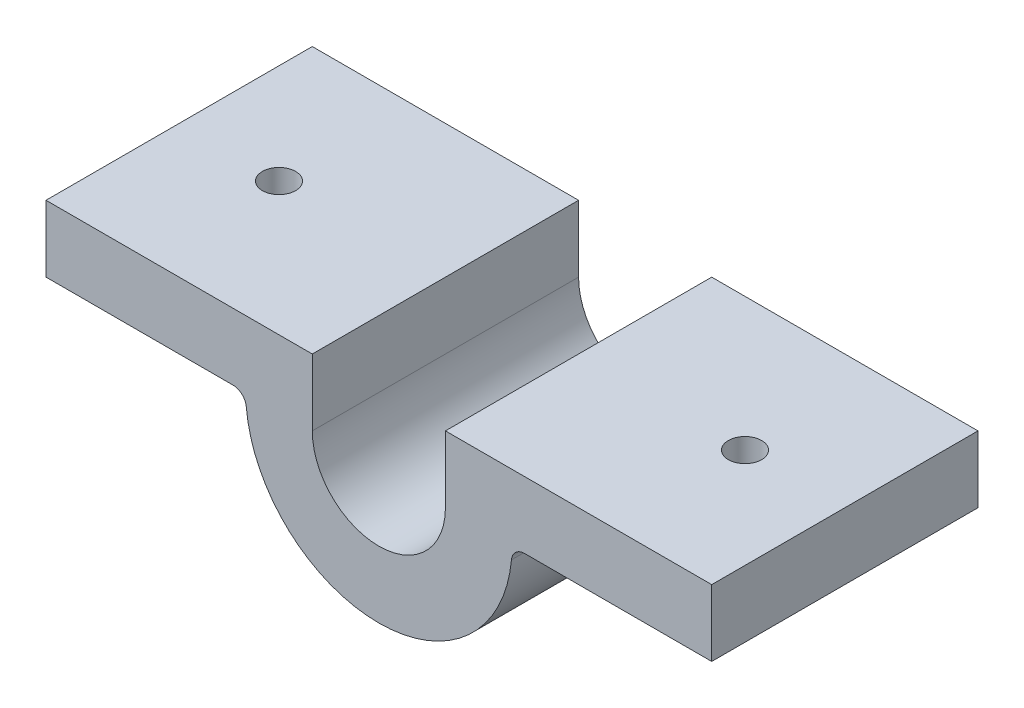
ISO-10303-21;
HEADER;
FILE_DESCRIPTION(('STEP AP214'),'2;1');
FILE_NAME('part.step','',(''),(''),'','','');
FILE_SCHEMA(('AUTOMOTIVE_DESIGN { 1 0 10303 214 1 1 1 1 }'));
ENDSEC;
DATA;
#1=APPLICATION_CONTEXT('core data for automotive mechanical design processes');
#2=APPLICATION_PROTOCOL_DEFINITION('international standard','automotive_design',2000,#1);
#3=PRODUCT_CONTEXT('',#1,'mechanical');
#4=PRODUCT('Part','Part','',(#3));
#5=PRODUCT_RELATED_PRODUCT_CATEGORY('part','',(#4));
#6=PRODUCT_DEFINITION_FORMATION('','',#4);
#7=PRODUCT_DEFINITION_CONTEXT('part definition',#1,'design');
#8=PRODUCT_DEFINITION('design','',#6,#7);
#9=PRODUCT_DEFINITION_SHAPE('','',#8);
#10=(LENGTH_UNIT() NAMED_UNIT(*) SI_UNIT(.MILLI.,.METRE.));
#11=(NAMED_UNIT(*) PLANE_ANGLE_UNIT() SI_UNIT($,.RADIAN.));
#12=(NAMED_UNIT(*) SI_UNIT($,.STERADIAN.) SOLID_ANGLE_UNIT());
#13=UNCERTAINTY_MEASURE_WITH_UNIT(LENGTH_MEASURE(1.E-05),#10,'distance_accuracy_value','');
#14=(GEOMETRIC_REPRESENTATION_CONTEXT(3) GLOBAL_UNCERTAINTY_ASSIGNED_CONTEXT((#13)) GLOBAL_UNIT_ASSIGNED_CONTEXT((#10,
#11,#12)) REPRESENTATION_CONTEXT('',''));
#15=CARTESIAN_POINT('',(0.,0.,0.));
#16=DIRECTION('',(0.,0.,1.));
#17=DIRECTION('',(1.,0.,0.));
#18=AXIS2_PLACEMENT_3D('',#15,#16,#17);
#19=CARTESIAN_POINT('',(-25.,5.,-20.));
#20=DIRECTION('',(-1.,0.,0.));
#21=DIRECTION('',(0.,0.,1.));
#22=AXIS2_PLACEMENT_3D('',#19,#20,#21);
#23=PLANE('',#22);
#24=DIRECTION('',(0.,-1.,0.));
#25=VECTOR('',#24,1.);
#26=CARTESIAN_POINT('',(-25.,5.,0.));
#27=LINE('',#26,#25);
#28=CARTESIAN_POINT('',(-25.,5.,0.));
#29=VERTEX_POINT('',#28);
#30=CARTESIAN_POINT('',(-25.,0.,0.));
#31=VERTEX_POINT('',#30);
#32=EDGE_CURVE('E170',#29,#31,#27,.T.);
#33=ORIENTED_EDGE('',*,*,#32,.F.);
#34=DIRECTION('',(0.,0.,1.));
#35=VECTOR('',#34,1.);
#36=CARTESIAN_POINT('',(-25.,5.,-20.));
#37=LINE('',#36,#35);
#38=CARTESIAN_POINT('',(-25.,5.,-20.));
#39=VERTEX_POINT('',#38);
#40=EDGE_CURVE('E140',#39,#29,#37,.T.);
#41=ORIENTED_EDGE('',*,*,#40,.F.);
#42=DIRECTION('',(0.,-1.,0.));
#43=VECTOR('',#42,1.);
#44=CARTESIAN_POINT('',(-25.,5.,-20.));
#45=LINE('',#44,#43);
#46=CARTESIAN_POINT('',(-25.,0.,-20.));
#47=VERTEX_POINT('',#46);
#48=EDGE_CURVE('E136',#39,#47,#45,.T.);
#49=ORIENTED_EDGE('',*,*,#48,.T.);
#50=DIRECTION('',(0.,0.,1.));
#51=VECTOR('',#50,1.);
#52=CARTESIAN_POINT('',(-25.,0.,-20.));
#53=LINE('',#52,#51);
#54=EDGE_CURVE('E121',#47,#31,#53,.T.);
#55=ORIENTED_EDGE('',*,*,#54,.T.);
#56=EDGE_LOOP('',(#33,#41,#49,#55));
#57=FACE_BOUND('',#56,.T.);
#58=ADVANCED_FACE('F33',(#57),#23,.T.);
#59=CARTESIAN_POINT('',(-25.,5.,-20.));
#60=DIRECTION('',(0.,1.,0.));
#61=DIRECTION('',(0.,0.,1.));
#62=AXIS2_PLACEMENT_3D('',#59,#60,#61);
#63=PLANE('',#62);
#64=CARTESIAN_POINT('',(-17.5,5.,-10.));
#65=DIRECTION('',(0.,1.,0.));
#66=DIRECTION('',(0.,0.,1.));
#67=AXIS2_PLACEMENT_3D('',#64,#65,#66);
#68=CIRCLE('',#67,1.25);
#69=CARTESIAN_POINT('',(-17.5,5.,-8.75));
#70=VERTEX_POINT('',#69);
#71=EDGE_CURVE('E283',#70,#70,#68,.T.);
#72=ORIENTED_EDGE('',*,*,#71,.F.);
#73=EDGE_LOOP('',(#72));
#74=FACE_BOUND('',#73,.T.);
#75=DIRECTION('',(-1.,0.,0.));
#76=VECTOR('',#75,1.);
#77=CARTESIAN_POINT('',(-25.,5.,0.));
#78=LINE('',#77,#76);
#79=CARTESIAN_POINT('',(-5.,5.,0.));
#80=VERTEX_POINT('',#79);
#81=EDGE_CURVE('E141',#80,#29,#78,.T.);
#82=ORIENTED_EDGE('',*,*,#81,.F.);
#83=DIRECTION('',(0.,0.,1.));
#84=VECTOR('',#83,1.);
#85=CARTESIAN_POINT('',(-5.,5.,-20.));
#86=LINE('',#85,#84);
#87=CARTESIAN_POINT('',(-5.,5.,-20.));
#88=VERTEX_POINT('',#87);
#89=EDGE_CURVE('E194',#88,#80,#86,.T.);
#90=ORIENTED_EDGE('',*,*,#89,.F.);
#91=DIRECTION('',(-1.,0.,0.));
#92=VECTOR('',#91,1.);
#93=CARTESIAN_POINT('',(-25.,5.,-20.));
#94=LINE('',#93,#92);
#95=EDGE_CURVE('E131',#88,#39,#94,.T.);
#96=ORIENTED_EDGE('',*,*,#95,.T.);
#97=ORIENTED_EDGE('',*,*,#40,.T.);
#98=EDGE_LOOP('',(#82,#90,#96,#97));
#99=FACE_BOUND('',#98,.T.);
#100=ADVANCED_FACE('F231',(#74,#99),#63,.T.);
#101=CARTESIAN_POINT('',(-5.,5.,-20.));
#102=DIRECTION('',(1.,0.,0.));
#103=DIRECTION('',(0.,0.,-1.));
#104=AXIS2_PLACEMENT_3D('',#101,#102,#103);
#105=PLANE('',#104);
#106=DIRECTION('',(0.,1.,0.));
#107=VECTOR('',#106,1.);
#108=CARTESIAN_POINT('',(-5.,5.,0.));
#109=LINE('',#108,#107);
#110=CARTESIAN_POINT('',(-5.,0.,0.));
#111=VERTEX_POINT('',#110);
#112=EDGE_CURVE('E144',#111,#80,#109,.T.);
#113=ORIENTED_EDGE('',*,*,#112,.F.);
#114=DIRECTION('',(0.,0.,1.));
#115=VECTOR('',#114,1.);
#116=CARTESIAN_POINT('',(-5.,0.,-20.));
#117=LINE('',#116,#115);
#118=CARTESIAN_POINT('',(-5.,0.,-20.));
#119=VERTEX_POINT('',#118);
#120=EDGE_CURVE('E196',#119,#111,#117,.T.);
#121=ORIENTED_EDGE('',*,*,#120,.F.);
#122=DIRECTION('',(0.,1.,0.));
#123=VECTOR('',#122,1.);
#124=CARTESIAN_POINT('',(-5.,5.,-20.));
#125=LINE('',#124,#123);
#126=EDGE_CURVE('E166',#119,#88,#125,.T.);
#127=ORIENTED_EDGE('',*,*,#126,.T.);
#128=ORIENTED_EDGE('',*,*,#89,.T.);
#129=EDGE_LOOP('',(#113,#121,#127,#128));
#130=FACE_BOUND('',#129,.T.);
#131=ADVANCED_FACE('F236',(#130),#105,.T.);
#132=CARTESIAN_POINT('',(0.,0.,-20.));
#133=DIRECTION('',(0.,0.,1.));
#134=DIRECTION('',(1.,0.,0.));
#135=AXIS2_PLACEMENT_3D('',#132,#133,#134);
#136=CYLINDRICAL_SURFACE('',#135,5.);
#137=CARTESIAN_POINT('',(0.,0.,0.));
#138=DIRECTION('',(0.,0.,-1.));
#139=DIRECTION('',(1.,0.,0.));
#140=AXIS2_PLACEMENT_3D('',#137,#138,#139);
#141=CIRCLE('',#140,5.);
#142=CARTESIAN_POINT('',(5.,0.,0.));
#143=VERTEX_POINT('',#142);
#144=EDGE_CURVE('E187',#143,#111,#141,.T.);
#145=ORIENTED_EDGE('',*,*,#144,.F.);
#146=DIRECTION('',(0.,0.,1.));
#147=VECTOR('',#146,1.);
#148=CARTESIAN_POINT('',(5.,0.,-20.));
#149=LINE('',#148,#147);
#150=CARTESIAN_POINT('',(5.,0.,-20.));
#151=VERTEX_POINT('',#150);
#152=EDGE_CURVE('E198',#151,#143,#149,.T.);
#153=ORIENTED_EDGE('',*,*,#152,.F.);
#154=CARTESIAN_POINT('',(0.,0.,-20.));
#155=DIRECTION('',(0.,0.,-1.));
#156=DIRECTION('',(1.,0.,0.));
#157=AXIS2_PLACEMENT_3D('',#154,#155,#156);
#158=CIRCLE('',#157,5.);
#159=EDGE_CURVE('E163',#151,#119,#158,.T.);
#160=ORIENTED_EDGE('',*,*,#159,.T.);
#161=ORIENTED_EDGE('',*,*,#120,.T.);
#162=EDGE_LOOP('',(#145,#153,#160,#161));
#163=FACE_BOUND('',#162,.T.);
#164=ADVANCED_FACE('F260',(#163),#136,.F.);
#165=CARTESIAN_POINT('',(5.,5.,-20.));
#166=DIRECTION('',(-1.,0.,0.));
#167=DIRECTION('',(0.,-1.,0.));
#168=AXIS2_PLACEMENT_3D('',#165,#166,#167);
#169=PLANE('',#168);
#170=DIRECTION('',(0.,-1.,0.));
#171=VECTOR('',#170,1.);
#172=CARTESIAN_POINT('',(5.,5.,0.));
#173=LINE('',#172,#171);
#174=CARTESIAN_POINT('',(5.,5.,0.));
#175=VERTEX_POINT('',#174);
#176=EDGE_CURVE('E184',#175,#143,#173,.T.);
#177=ORIENTED_EDGE('',*,*,#176,.F.);
#178=DIRECTION('',(0.,0.,1.));
#179=VECTOR('',#178,1.);
#180=CARTESIAN_POINT('',(5.,5.,-20.));
#181=LINE('',#180,#179);
#182=CARTESIAN_POINT('',(5.,5.,-20.));
#183=VERTEX_POINT('',#182);
#184=EDGE_CURVE('E200',#183,#175,#181,.T.);
#185=ORIENTED_EDGE('',*,*,#184,.F.);
#186=DIRECTION('',(0.,-1.,0.));
#187=VECTOR('',#186,1.);
#188=CARTESIAN_POINT('',(5.,5.,-20.));
#189=LINE('',#188,#187);
#190=EDGE_CURVE('E160',#183,#151,#189,.T.);
#191=ORIENTED_EDGE('',*,*,#190,.T.);
#192=ORIENTED_EDGE('',*,*,#152,.T.);
#193=EDGE_LOOP('',(#177,#185,#191,#192));
#194=FACE_BOUND('',#193,.T.);
#195=ADVANCED_FACE('F256',(#194),#169,.T.);
#196=CARTESIAN_POINT('',(5.,5.,-20.));
#197=DIRECTION('',(0.,1.,0.));
#198=DIRECTION('',(0.,0.,1.));
#199=AXIS2_PLACEMENT_3D('',#196,#197,#198);
#200=PLANE('',#199);
#201=CARTESIAN_POINT('',(17.5,5.,-10.));
#202=DIRECTION('',(0.,1.,0.));
#203=DIRECTION('',(0.,0.,1.));
#204=AXIS2_PLACEMENT_3D('',#201,#202,#203);
#205=CIRCLE('',#204,1.25);
#206=CARTESIAN_POINT('',(17.5,5.,-8.75));
#207=VERTEX_POINT('',#206);
#208=EDGE_CURVE('E147',#207,#207,#205,.T.);
#209=ORIENTED_EDGE('',*,*,#208,.F.);
#210=EDGE_LOOP('',(#209));
#211=FACE_BOUND('',#210,.T.);
#212=DIRECTION('',(-1.,0.,0.));
#213=VECTOR('',#212,1.);
#214=CARTESIAN_POINT('',(5.,5.,0.));
#215=LINE('',#214,#213);
#216=CARTESIAN_POINT('',(25.,5.,0.));
#217=VERTEX_POINT('',#216);
#218=EDGE_CURVE('E181',#217,#175,#215,.T.);
#219=ORIENTED_EDGE('',*,*,#218,.F.);
#220=DIRECTION('',(0.,0.,1.));
#221=VECTOR('',#220,1.);
#222=CARTESIAN_POINT('',(25.,5.,-20.));
#223=LINE('',#222,#221);
#224=CARTESIAN_POINT('',(25.,5.,-20.));
#225=VERTEX_POINT('',#224);
#226=EDGE_CURVE('E202',#225,#217,#223,.T.);
#227=ORIENTED_EDGE('',*,*,#226,.F.);
#228=DIRECTION('',(-1.,0.,0.));
#229=VECTOR('',#228,1.);
#230=CARTESIAN_POINT('',(5.,5.,-20.));
#231=LINE('',#230,#229);
#232=EDGE_CURVE('E157',#225,#183,#231,.T.);
#233=ORIENTED_EDGE('',*,*,#232,.T.);
#234=ORIENTED_EDGE('',*,*,#184,.T.);
#235=EDGE_LOOP('',(#219,#227,#233,#234));
#236=FACE_BOUND('',#235,.T.);
#237=ADVANCED_FACE('F252',(#211,#236),#200,.T.);
#238=CARTESIAN_POINT('',(25.,5.,-20.));
#239=DIRECTION('',(1.,0.,0.));
#240=DIRECTION('',(0.,0.,-1.));
#241=AXIS2_PLACEMENT_3D('',#238,#239,#240);
#242=PLANE('',#241);
#243=DIRECTION('',(0.,1.,0.));
#244=VECTOR('',#243,1.);
#245=CARTESIAN_POINT('',(25.,5.,0.));
#246=LINE('',#245,#244);
#247=CARTESIAN_POINT('',(25.,0.,0.));
#248=VERTEX_POINT('',#247);
#249=EDGE_CURVE('E178',#248,#217,#246,.T.);
#250=ORIENTED_EDGE('',*,*,#249,.F.);
#251=DIRECTION('',(0.,0.,1.));
#252=VECTOR('',#251,1.);
#253=CARTESIAN_POINT('',(25.,0.,-20.));
#254=LINE('',#253,#252);
#255=CARTESIAN_POINT('',(25.,0.,-20.));
#256=VERTEX_POINT('',#255);
#257=EDGE_CURVE('E130',#256,#248,#254,.T.);
#258=ORIENTED_EDGE('',*,*,#257,.F.);
#259=DIRECTION('',(0.,1.,0.));
#260=VECTOR('',#259,1.);
#261=CARTESIAN_POINT('',(25.,5.,-20.));
#262=LINE('',#261,#260);
#263=EDGE_CURVE('E154',#256,#225,#262,.T.);
#264=ORIENTED_EDGE('',*,*,#263,.T.);
#265=ORIENTED_EDGE('',*,*,#226,.T.);
#266=EDGE_LOOP('',(#250,#258,#264,#265));
#267=FACE_BOUND('',#266,.T.);
#268=ADVANCED_FACE('F248',(#267),#242,.T.);
#269=CARTESIAN_POINT('',(10.,0.,-20.));
#270=DIRECTION('',(0.,-1.,0.));
#271=DIRECTION('',(1.,0.,0.));
#272=AXIS2_PLACEMENT_3D('',#269,#270,#271);
#273=PLANE('',#272);
#274=CARTESIAN_POINT('',(17.5,0.,-10.));
#275=DIRECTION('',(0.,-1.,0.));
#276=DIRECTION('',(0.,0.,-1.));
#277=AXIS2_PLACEMENT_3D('',#274,#275,#276);
#278=CIRCLE('',#277,1.25);
#279=CARTESIAN_POINT('',(17.5,0.,-11.25));
#280=VERTEX_POINT('',#279);
#281=EDGE_CURVE('E287',#280,#280,#278,.T.);
#282=ORIENTED_EDGE('',*,*,#281,.F.);
#283=EDGE_LOOP('',(#282));
#284=FACE_BOUND('',#283,.T.);
#285=DIRECTION('',(1.,0.,0.));
#286=VECTOR('',#285,1.);
#287=CARTESIAN_POINT('',(10.,0.,0.));
#288=LINE('',#287,#286);
#289=CARTESIAN_POINT('',(10.9544511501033,0.,0.));
#290=VERTEX_POINT('',#289);
#291=EDGE_CURVE('E176',#290,#248,#288,.T.);
#292=ORIENTED_EDGE('',*,*,#291,.F.);
#293=DIRECTION('',(0.,0.,-1.));
#294=VECTOR('',#293,1.);
#295=CARTESIAN_POINT('',(10.9544511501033,0.,-20.));
#296=LINE('',#295,#294);
#297=CARTESIAN_POINT('',(10.9544511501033,0.,-20.));
#298=VERTEX_POINT('',#297);
#299=EDGE_CURVE('E210',#290,#298,#296,.T.);
#300=ORIENTED_EDGE('',*,*,#299,.T.);
#301=DIRECTION('',(1.,0.,0.));
#302=VECTOR('',#301,1.);
#303=CARTESIAN_POINT('',(10.,0.,-20.));
#304=LINE('',#303,#302);
#305=EDGE_CURVE('E152',#298,#256,#304,.T.);
#306=ORIENTED_EDGE('',*,*,#305,.T.);
#307=ORIENTED_EDGE('',*,*,#257,.T.);
#308=EDGE_LOOP('',(#292,#300,#306,#307));
#309=FACE_BOUND('',#308,.T.);
#310=ADVANCED_FACE('F245',(#284,#309),#273,.T.);
#311=CARTESIAN_POINT('',(0.,0.,-20.));
#312=DIRECTION('',(0.,0.,1.));
#313=DIRECTION('',(1.,0.,0.));
#314=AXIS2_PLACEMENT_3D('',#311,#312,#313);
#315=CYLINDRICAL_SURFACE('',#314,10.);
#316=CARTESIAN_POINT('',(0.,0.,-20.));
#317=DIRECTION('',(0.,0.,1.));
#318=DIRECTION('',(1.,0.,0.));
#319=AXIS2_PLACEMENT_3D('',#316,#317,#318);
#320=CIRCLE('',#319,10.);
#321=CARTESIAN_POINT('',(-9.95859195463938,-0.90909090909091,-20.));
#322=VERTEX_POINT('',#321);
#323=CARTESIAN_POINT('',(9.95859195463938,-0.909090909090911,-20.));
#324=VERTEX_POINT('',#323);
#325=EDGE_CURVE('E138',#322,#324,#320,.T.);
#326=ORIENTED_EDGE('',*,*,#325,.T.);
#327=DIRECTION('',(0.,0.,1.));
#328=VECTOR('',#327,1.);
#329=CARTESIAN_POINT('',(9.95859195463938,-0.909090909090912,-20.));
#330=LINE('',#329,#328);
#331=CARTESIAN_POINT('',(9.95859195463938,-0.909090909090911,0.));
#332=VERTEX_POINT('',#331);
#333=EDGE_CURVE('E207',#324,#332,#330,.T.);
#334=ORIENTED_EDGE('',*,*,#333,.T.);
#335=CARTESIAN_POINT('',(0.,0.,0.));
#336=DIRECTION('',(0.,0.,1.));
#337=DIRECTION('',(1.,0.,0.));
#338=AXIS2_PLACEMENT_3D('',#335,#336,#337);
#339=CIRCLE('',#338,10.);
#340=CARTESIAN_POINT('',(-9.95859195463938,-0.90909090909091,0.));
#341=VERTEX_POINT('',#340);
#342=EDGE_CURVE('E173',#341,#332,#339,.T.);
#343=ORIENTED_EDGE('',*,*,#342,.F.);
#344=DIRECTION('',(0.,0.,1.));
#345=VECTOR('',#344,1.);
#346=CARTESIAN_POINT('',(-9.95859195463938,-0.90909090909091,-20.));
#347=LINE('',#346,#345);
#348=EDGE_CURVE('E193',#341,#322,#347,.F.);
#349=ORIENTED_EDGE('',*,*,#348,.T.);
#350=EDGE_LOOP('',(#326,#334,#343,#349));
#351=FACE_BOUND('',#350,.T.);
#352=ADVANCED_FACE('F221',(#351),#315,.T.);
#353=CARTESIAN_POINT('',(-25.,0.,-20.));
#354=DIRECTION('',(0.,-1.,0.));
#355=DIRECTION('',(0.,0.,-1.));
#356=AXIS2_PLACEMENT_3D('',#353,#354,#355);
#357=PLANE('',#356);
#358=CARTESIAN_POINT('',(-17.5,0.,-10.));
#359=DIRECTION('',(0.,-1.,0.));
#360=DIRECTION('',(0.,0.,-1.));
#361=AXIS2_PLACEMENT_3D('',#358,#359,#360);
#362=CIRCLE('',#361,1.25);
#363=CARTESIAN_POINT('',(-17.5,0.,-11.25));
#364=VERTEX_POINT('',#363);
#365=EDGE_CURVE('E286',#364,#364,#362,.T.);
#366=ORIENTED_EDGE('',*,*,#365,.F.);
#367=EDGE_LOOP('',(#366));
#368=FACE_BOUND('',#367,.T.);
#369=DIRECTION('',(1.,0.,0.));
#370=VECTOR('',#369,1.);
#371=CARTESIAN_POINT('',(-25.,0.,-20.));
#372=LINE('',#371,#370);
#373=CARTESIAN_POINT('',(-10.9544511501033,0.,-20.));
#374=VERTEX_POINT('',#373);
#375=EDGE_CURVE('E123',#47,#374,#372,.T.);
#376=ORIENTED_EDGE('',*,*,#375,.T.);
#377=DIRECTION('',(0.,0.,-1.));
#378=VECTOR('',#377,1.);
#379=CARTESIAN_POINT('',(-10.9544511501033,0.,0.));
#380=LINE('',#379,#378);
#381=CARTESIAN_POINT('',(-10.9544511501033,0.,0.));
#382=VERTEX_POINT('',#381);
#383=EDGE_CURVE('E212',#374,#382,#380,.F.);
#384=ORIENTED_EDGE('',*,*,#383,.T.);
#385=DIRECTION('',(1.,0.,0.));
#386=VECTOR('',#385,1.);
#387=CARTESIAN_POINT('',(-25.,0.,0.));
#388=LINE('',#387,#386);
#389=EDGE_CURVE('E125',#31,#382,#388,.T.);
#390=ORIENTED_EDGE('',*,*,#389,.F.);
#391=ORIENTED_EDGE('',*,*,#54,.F.);
#392=EDGE_LOOP('',(#376,#384,#390,#391));
#393=FACE_BOUND('',#392,.T.);
#394=ADVANCED_FACE('F122',(#368,#393),#357,.T.);
#395=CARTESIAN_POINT('',(0.,0.,-20.));
#396=DIRECTION('',(0.,0.,1.));
#397=DIRECTION('',(1.,0.,0.));
#398=AXIS2_PLACEMENT_3D('',#395,#396,#397);
#399=PLANE('',#398);
#400=ORIENTED_EDGE('',*,*,#48,.F.);
#401=ORIENTED_EDGE('',*,*,#95,.F.);
#402=ORIENTED_EDGE('',*,*,#126,.F.);
#403=ORIENTED_EDGE('',*,*,#159,.F.);
#404=ORIENTED_EDGE('',*,*,#190,.F.);
#405=ORIENTED_EDGE('',*,*,#232,.F.);
#406=ORIENTED_EDGE('',*,*,#263,.F.);
#407=ORIENTED_EDGE('',*,*,#305,.F.);
#408=CARTESIAN_POINT('',(10.9544511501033,-1.,-20.));
#409=DIRECTION('',(0.,0.,1.));
#410=DIRECTION('',(1.,0.,0.));
#411=AXIS2_PLACEMENT_3D('',#408,#409,#410);
#412=CIRCLE('',#411,1.);
#413=EDGE_CURVE('E216',#298,#324,#412,.T.);
#414=ORIENTED_EDGE('',*,*,#413,.T.);
#415=ORIENTED_EDGE('',*,*,#325,.F.);
#416=CARTESIAN_POINT('',(-10.9544511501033,-1.,-20.));
#417=DIRECTION('',(0.,0.,1.));
#418=DIRECTION('',(1.,0.,0.));
#419=AXIS2_PLACEMENT_3D('',#416,#417,#418);
#420=CIRCLE('',#419,1.);
#421=EDGE_CURVE('E11',#322,#374,#420,.T.);
#422=ORIENTED_EDGE('',*,*,#421,.T.);
#423=ORIENTED_EDGE('',*,*,#375,.F.);
#424=EDGE_LOOP('',(#400,#401,#402,#403,#404,#405,#406,#407,#414,#415,#422,#423));
#425=FACE_BOUND('',#424,.T.);
#426=ADVANCED_FACE('F134',(#425),#399,.F.);
#427=CARTESIAN_POINT('',(0.,0.,0.));
#428=DIRECTION('',(0.,0.,1.));
#429=DIRECTION('',(1.,0.,0.));
#430=AXIS2_PLACEMENT_3D('',#427,#428,#429);
#431=PLANE('',#430);
#432=ORIENTED_EDGE('',*,*,#32,.T.);
#433=ORIENTED_EDGE('',*,*,#389,.T.);
#434=CARTESIAN_POINT('',(-10.9544511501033,-1.,0.));
#435=DIRECTION('',(0.,0.,1.));
#436=DIRECTION('',(1.,0.,0.));
#437=AXIS2_PLACEMENT_3D('',#434,#435,#436);
#438=CIRCLE('',#437,1.);
#439=EDGE_CURVE('E41',#382,#341,#438,.F.);
#440=ORIENTED_EDGE('',*,*,#439,.T.);
#441=ORIENTED_EDGE('',*,*,#342,.T.);
#442=CARTESIAN_POINT('',(10.9544511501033,-1.,0.));
#443=DIRECTION('',(0.,0.,1.));
#444=DIRECTION('',(1.,0.,0.));
#445=AXIS2_PLACEMENT_3D('',#442,#443,#444);
#446=CIRCLE('',#445,1.);
#447=EDGE_CURVE('E214',#332,#290,#446,.F.);
#448=ORIENTED_EDGE('',*,*,#447,.T.);
#449=ORIENTED_EDGE('',*,*,#291,.T.);
#450=ORIENTED_EDGE('',*,*,#249,.T.);
#451=ORIENTED_EDGE('',*,*,#218,.T.);
#452=ORIENTED_EDGE('',*,*,#176,.T.);
#453=ORIENTED_EDGE('',*,*,#144,.T.);
#454=ORIENTED_EDGE('',*,*,#112,.T.);
#455=ORIENTED_EDGE('',*,*,#81,.T.);
#456=EDGE_LOOP('',(#432,#433,#440,#441,#448,#449,#450,#451,#452,#453,#454,#455));
#457=FACE_BOUND('',#456,.T.);
#458=ADVANCED_FACE('F219',(#457),#431,.T.);
#459=CARTESIAN_POINT('',(-17.5,20.,-10.));
#460=DIRECTION('',(0.,-1.,0.));
#461=DIRECTION('',(0.,0.,-1.));
#462=AXIS2_PLACEMENT_3D('',#459,#460,#461);
#463=CYLINDRICAL_SURFACE('',#462,1.25);
#464=ORIENTED_EDGE('',*,*,#71,.T.);
#465=EDGE_LOOP('',(#464));
#466=FACE_BOUND('',#465,.T.);
#467=ORIENTED_EDGE('',*,*,#365,.T.);
#468=EDGE_LOOP('',(#467));
#469=FACE_BOUND('',#468,.T.);
#470=ADVANCED_FACE('F270',(#466,#469),#463,.F.);
#471=CARTESIAN_POINT('',(17.5,20.,-10.));
#472=DIRECTION('',(0.,-1.,0.));
#473=DIRECTION('',(0.,0.,-1.));
#474=AXIS2_PLACEMENT_3D('',#471,#472,#473);
#475=CYLINDRICAL_SURFACE('',#474,1.25);
#476=ORIENTED_EDGE('',*,*,#208,.T.);
#477=EDGE_LOOP('',(#476));
#478=FACE_BOUND('',#477,.T.);
#479=ORIENTED_EDGE('',*,*,#281,.T.);
#480=EDGE_LOOP('',(#479));
#481=FACE_BOUND('',#480,.T.);
#482=ADVANCED_FACE('F228',(#478,#481),#475,.F.);
#483=CARTESIAN_POINT('',(10.9544511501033,-1.,-20.));
#484=DIRECTION('',(0.,0.,1.));
#485=DIRECTION('',(1.,0.,0.));
#486=AXIS2_PLACEMENT_3D('',#483,#484,#485);
#487=CYLINDRICAL_SURFACE('',#486,1.);
#488=ORIENTED_EDGE('',*,*,#413,.F.);
#489=ORIENTED_EDGE('',*,*,#299,.F.);
#490=ORIENTED_EDGE('',*,*,#447,.F.);
#491=ORIENTED_EDGE('',*,*,#333,.F.);
#492=EDGE_LOOP('',(#488,#489,#490,#491));
#493=FACE_BOUND('',#492,.T.);
#494=ADVANCED_FACE('F224',(#493),#487,.F.);
#495=CARTESIAN_POINT('',(-10.9544511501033,-1.,-20.));
#496=DIRECTION('',(0.,0.,1.));
#497=DIRECTION('',(1.,0.,0.));
#498=AXIS2_PLACEMENT_3D('',#495,#496,#497);
#499=CYLINDRICAL_SURFACE('',#498,1.);
#500=ORIENTED_EDGE('',*,*,#421,.F.);
#501=ORIENTED_EDGE('',*,*,#348,.F.);
#502=ORIENTED_EDGE('',*,*,#439,.F.);
#503=ORIENTED_EDGE('',*,*,#383,.F.);
#504=EDGE_LOOP('',(#500,#501,#502,#503));
#505=FACE_BOUND('',#504,.T.);
#506=ADVANCED_FACE('F35',(#505),#499,.F.);
#507=CLOSED_SHELL('',(#58,#100,#131,#164,#195,#237,#268,#310,#352,#394,#426,#458,#470,#482,#494,#506));
#508=MANIFOLD_SOLID_BREP('B2',#507);
#509=ADVANCED_BREP_SHAPE_REPRESENTATION('',(#18,#508),#14);
#510=SHAPE_DEFINITION_REPRESENTATION(#9,#509);
ENDSEC;
END-ISO-10303-21;
